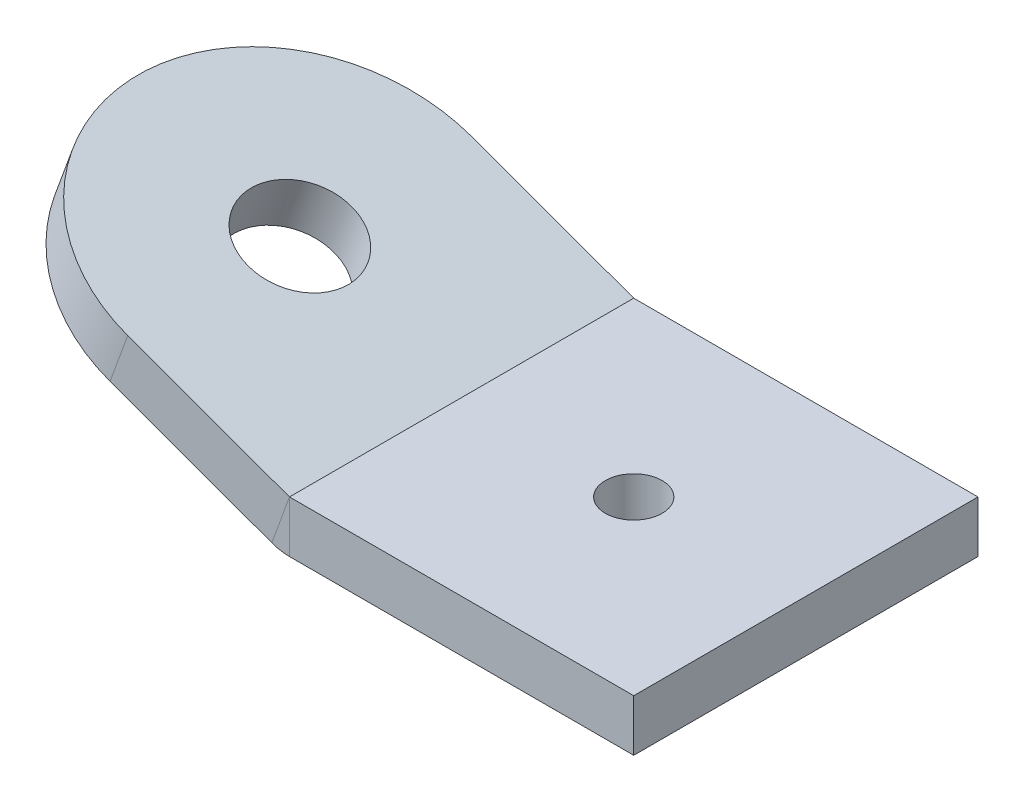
ISO-10303-21;
HEADER;
FILE_DESCRIPTION(('STEP AP214'),'2;1');
FILE_NAME('part.step','',(''),(''),'','','');
FILE_SCHEMA(('AUTOMOTIVE_DESIGN { 1 0 10303 214 1 1 1 1 }'));
ENDSEC;
DATA;
#1=APPLICATION_CONTEXT('core data for automotive mechanical design processes');
#2=APPLICATION_PROTOCOL_DEFINITION('international standard','automotive_design',2000,#1);
#3=PRODUCT_CONTEXT('',#1,'mechanical');
#4=PRODUCT('Part','Part','',(#3));
#5=PRODUCT_RELATED_PRODUCT_CATEGORY('part','',(#4));
#6=PRODUCT_DEFINITION_FORMATION('','',#4);
#7=PRODUCT_DEFINITION_CONTEXT('part definition',#1,'design');
#8=PRODUCT_DEFINITION('design','',#6,#7);
#9=PRODUCT_DEFINITION_SHAPE('','',#8);
#10=(LENGTH_UNIT() NAMED_UNIT(*) SI_UNIT(.MILLI.,.METRE.));
#11=(NAMED_UNIT(*) PLANE_ANGLE_UNIT() SI_UNIT($,.RADIAN.));
#12=(NAMED_UNIT(*) SI_UNIT($,.STERADIAN.) SOLID_ANGLE_UNIT());
#13=UNCERTAINTY_MEASURE_WITH_UNIT(LENGTH_MEASURE(1.E-05),#10,'distance_accuracy_value','');
#14=(GEOMETRIC_REPRESENTATION_CONTEXT(3) GLOBAL_UNCERTAINTY_ASSIGNED_CONTEXT((#13)) GLOBAL_UNIT_ASSIGNED_CONTEXT((#10,
#11,#12)) REPRESENTATION_CONTEXT('',''));
#15=CARTESIAN_POINT('',(0.,0.,0.));
#16=DIRECTION('',(0.,0.,1.));
#17=DIRECTION('',(1.,0.,0.));
#18=AXIS2_PLACEMENT_3D('',#15,#16,#17);
#19=CARTESIAN_POINT('',(0.603080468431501,6.42020025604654,-9.99999999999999));
#20=DIRECTION('',(0.,0.,1.));
#21=DIRECTION('',(0.939692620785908,-0.342020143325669,0.));
#22=AXIS2_PLACEMENT_3D('',#19,#20,#21);
#23=PLANE('',#22);
#24=DIRECTION('',(-0.939692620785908,0.342020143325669,0.));
#25=VECTOR('',#24,1.);
#26=CARTESIAN_POINT('',(0.603080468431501,6.42020025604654,-9.99999999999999));
#27=LINE('',#26,#25);
#28=CARTESIAN_POINT('',(9.99983774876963,3.00006030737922,-9.99999999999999));
#29=VERTEX_POINT('',#28);
#30=CARTESIAN_POINT('',(0.603080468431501,6.42020025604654,-9.99999999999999));
#31=VERTEX_POINT('',#30);
#32=EDGE_CURVE('E53',#29,#31,#27,.T.);
#33=ORIENTED_EDGE('',*,*,#32,.F.);
#34=DIRECTION('',(-0.342020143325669,-0.939692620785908,0.));
#35=VECTOR('',#34,1.);
#36=CARTESIAN_POINT('',(9.99983774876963,3.00006030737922,-9.99999999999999));
#37=LINE('',#36,#35);
#38=CARTESIAN_POINT('',(8.97377731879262,0.180982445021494,-9.99999999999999));
#39=VERTEX_POINT('',#38);
#40=EDGE_CURVE('E14',#29,#39,#37,.T.);
#41=ORIENTED_EDGE('',*,*,#40,.T.);
#42=DIRECTION('',(-0.939692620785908,0.342020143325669,0.));
#43=VECTOR('',#42,1.);
#44=CARTESIAN_POINT('',(-0.422979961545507,3.60112239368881,-9.99999999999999));
#45=LINE('',#44,#43);
#46=CARTESIAN_POINT('',(-0.422979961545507,3.60112239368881,-9.99999999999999));
#47=VERTEX_POINT('',#46);
#48=EDGE_CURVE('E66',#39,#47,#45,.T.);
#49=ORIENTED_EDGE('',*,*,#48,.T.);
#50=DIRECTION('',(-0.342020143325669,-0.939692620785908,0.));
#51=VECTOR('',#50,1.);
#52=CARTESIAN_POINT('',(0.603080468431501,6.42020025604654,-9.99999999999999));
#53=LINE('',#52,#51);
#54=EDGE_CURVE('E194',#31,#47,#53,.T.);
#55=ORIENTED_EDGE('',*,*,#54,.F.);
#56=EDGE_LOOP('',(#33,#41,#49,#55));
#57=FACE_BOUND('',#56,.T.);
#58=ADVANCED_FACE('F50',(#57),#23,.F.);
#59=CARTESIAN_POINT('',(28.7938590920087,-3.84040404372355,9.99999999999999));
#60=DIRECTION('',(0.,0.,-1.));
#61=DIRECTION('',(-0.939692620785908,0.342020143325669,0.));
#62=AXIS2_PLACEMENT_3D('',#59,#60,#61);
#63=PLANE('',#62);
#64=DIRECTION('',(0.939692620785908,-0.342020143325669,0.));
#65=VECTOR('',#64,1.);
#66=CARTESIAN_POINT('',(27.7677986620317,-6.65948190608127,9.99999999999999));
#67=LINE('',#66,#65);
#68=CARTESIAN_POINT('',(-0.422979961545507,3.60112239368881,9.99999999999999));
#69=VERTEX_POINT('',#68);
#70=CARTESIAN_POINT('',(8.97377731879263,0.18098244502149,9.99999999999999));
#71=VERTEX_POINT('',#70);
#72=EDGE_CURVE('E73',#69,#71,#67,.T.);
#73=ORIENTED_EDGE('',*,*,#72,.T.);
#74=DIRECTION('',(0.342020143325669,0.939692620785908,0.));
#75=VECTOR('',#74,1.);
#76=CARTESIAN_POINT('',(9.99983774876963,3.00006030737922,9.99999999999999));
#77=LINE('',#76,#75);
#78=CARTESIAN_POINT('',(9.99983774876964,3.00006030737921,9.99999999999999));
#79=VERTEX_POINT('',#78);
#80=EDGE_CURVE('E200',#71,#79,#77,.T.);
#81=ORIENTED_EDGE('',*,*,#80,.T.);
#82=DIRECTION('',(0.939692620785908,-0.342020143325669,0.));
#83=VECTOR('',#82,1.);
#84=CARTESIAN_POINT('',(28.7938590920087,-3.84040404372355,9.99999999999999));
#85=LINE('',#84,#83);
#86=CARTESIAN_POINT('',(0.603080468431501,6.42020025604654,9.99999999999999));
#87=VERTEX_POINT('',#86);
#88=EDGE_CURVE('E191',#87,#79,#85,.T.);
#89=ORIENTED_EDGE('',*,*,#88,.F.);
#90=DIRECTION('',(-0.342020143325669,-0.939692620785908,0.));
#91=VECTOR('',#90,1.);
#92=CARTESIAN_POINT('',(0.603080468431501,6.42020025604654,9.99999999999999));
#93=LINE('',#92,#91);
#94=EDGE_CURVE('E197',#87,#69,#93,.T.);
#95=ORIENTED_EDGE('',*,*,#94,.T.);
#96=EDGE_LOOP('',(#73,#81,#89,#95));
#97=FACE_BOUND('',#96,.T.);
#98=ADVANCED_FACE('F216',(#97),#63,.F.);
#99=CARTESIAN_POINT('',(-0.422979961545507,3.60112239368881,0.));
#100=DIRECTION('',(0.342020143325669,0.939692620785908,0.));
#101=DIRECTION('',(0.,0.,1.));
#102=AXIS2_PLACEMENT_3D('',#99,#100,#101);
#103=PLANE('',#102);
#104=CARTESIAN_POINT('',(-0.422979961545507,3.60112239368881,0.));
#105=DIRECTION('',(0.342020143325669,0.939692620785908,0.));
#106=DIRECTION('',(0.,0.,1.));
#107=AXIS2_PLACEMENT_3D('',#104,#105,#106);
#108=CIRCLE('',#107,3.);
#109=CARTESIAN_POINT('',(-0.422979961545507,3.60112239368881,3.));
#110=VERTEX_POINT('',#109);
#111=EDGE_CURVE('E165',#110,#110,#108,.T.);
#112=ORIENTED_EDGE('',*,*,#111,.T.);
#113=EDGE_LOOP('',(#112));
#114=FACE_BOUND('',#113,.T.);
#115=ORIENTED_EDGE('',*,*,#48,.F.);
#116=DIRECTION('',(0.,0.,1.));
#117=VECTOR('',#116,1.);
#118=CARTESIAN_POINT('',(8.97377731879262,0.180982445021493,0.));
#119=LINE('',#118,#117);
#120=EDGE_CURVE('E58',#39,#71,#119,.T.);
#121=ORIENTED_EDGE('',*,*,#120,.T.);
#122=ORIENTED_EDGE('',*,*,#72,.F.);
#123=CARTESIAN_POINT('',(-0.422979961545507,3.60112239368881,0.));
#124=DIRECTION('',(0.342020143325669,0.939692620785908,0.));
#125=DIRECTION('',(0.,0.,1.));
#126=AXIS2_PLACEMENT_3D('',#123,#124,#125);
#127=CIRCLE('',#126,9.99999999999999);
#128=EDGE_CURVE('E185',#47,#69,#127,.T.);
#129=ORIENTED_EDGE('',*,*,#128,.F.);
#130=EDGE_LOOP('',(#115,#121,#122,#129));
#131=FACE_BOUND('',#130,.T.);
#132=ADVANCED_FACE('F251',(#114,#131),#103,.F.);
#133=CARTESIAN_POINT('',(0.603080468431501,6.42020025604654,0.));
#134=DIRECTION('',(0.342020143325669,0.939692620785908,0.));
#135=DIRECTION('',(0.,0.,1.));
#136=AXIS2_PLACEMENT_3D('',#133,#134,#135);
#137=PLANE('',#136);
#138=DIRECTION('',(0.,0.,1.));
#139=VECTOR('',#138,1.);
#140=CARTESIAN_POINT('',(9.99983774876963,3.00006030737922,0.));
#141=LINE('',#140,#139);
#142=EDGE_CURVE('E151',#29,#79,#141,.T.);
#143=ORIENTED_EDGE('',*,*,#142,.F.);
#144=ORIENTED_EDGE('',*,*,#32,.T.);
#145=CARTESIAN_POINT('',(0.603080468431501,6.42020025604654,0.));
#146=DIRECTION('',(0.342020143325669,0.939692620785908,0.));
#147=DIRECTION('',(0.,0.,1.));
#148=AXIS2_PLACEMENT_3D('',#145,#146,#147);
#149=CIRCLE('',#148,9.99999999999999);
#150=EDGE_CURVE('E188',#31,#87,#149,.T.);
#151=ORIENTED_EDGE('',*,*,#150,.T.);
#152=ORIENTED_EDGE('',*,*,#88,.T.);
#153=EDGE_LOOP('',(#143,#144,#151,#152));
#154=FACE_BOUND('',#153,.T.);
#155=CARTESIAN_POINT('',(0.603080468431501,6.42020025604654,0.));
#156=DIRECTION('',(0.342020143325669,0.939692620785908,0.));
#157=DIRECTION('',(0.,0.,1.));
#158=AXIS2_PLACEMENT_3D('',#155,#156,#157);
#159=CIRCLE('',#158,3.);
#160=CARTESIAN_POINT('',(0.603080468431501,6.42020025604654,3.));
#161=VERTEX_POINT('',#160);
#162=EDGE_CURVE('E182',#161,#161,#159,.T.);
#163=ORIENTED_EDGE('',*,*,#162,.F.);
#164=EDGE_LOOP('',(#163));
#165=FACE_BOUND('',#164,.T.);
#166=ADVANCED_FACE('F208',(#154,#165),#137,.T.);
#167=CARTESIAN_POINT('',(0.603080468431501,6.42020025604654,0.));
#168=DIRECTION('',(-0.342020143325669,-0.939692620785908,0.));
#169=DIRECTION('',(0.,0.,-1.));
#170=AXIS2_PLACEMENT_3D('',#167,#168,#169);
#171=CYLINDRICAL_SURFACE('',#170,9.99999999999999);
#172=ORIENTED_EDGE('',*,*,#128,.T.);
#173=ORIENTED_EDGE('',*,*,#94,.F.);
#174=ORIENTED_EDGE('',*,*,#150,.F.);
#175=ORIENTED_EDGE('',*,*,#54,.T.);
#176=EDGE_LOOP('',(#172,#173,#174,#175));
#177=FACE_BOUND('',#176,.T.);
#178=ADVANCED_FACE('F215',(#177),#171,.T.);
#179=CARTESIAN_POINT('',(0.603080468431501,6.42020025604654,0.));
#180=DIRECTION('',(-0.342020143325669,-0.939692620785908,0.));
#181=DIRECTION('',(0.,0.,-1.));
#182=AXIS2_PLACEMENT_3D('',#179,#180,#181);
#183=CYLINDRICAL_SURFACE('',#182,3.);
#184=ORIENTED_EDGE('',*,*,#162,.T.);
#185=EDGE_LOOP('',(#184));
#186=FACE_BOUND('',#185,.T.);
#187=ORIENTED_EDGE('',*,*,#111,.F.);
#188=EDGE_LOOP('',(#187));
#189=FACE_BOUND('',#188,.T.);
#190=ADVANCED_FACE('F236',(#186,#189),#183,.F.);
#191=CARTESIAN_POINT('',(30.,3.,-9.99999999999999));
#192=DIRECTION('',(-1.,0.,0.));
#193=DIRECTION('',(0.,0.,1.));
#194=AXIS2_PLACEMENT_3D('',#191,#192,#193);
#195=PLANE('',#194);
#196=DIRECTION('',(0.,0.,-1.));
#197=VECTOR('',#196,1.);
#198=CARTESIAN_POINT('',(30.,0.,-9.99999999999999));
#199=LINE('',#198,#197);
#200=CARTESIAN_POINT('',(30.,0.,9.99999999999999));
#201=VERTEX_POINT('',#200);
#202=CARTESIAN_POINT('',(30.,0.,-9.99999999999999));
#203=VERTEX_POINT('',#202);
#204=EDGE_CURVE('E146',#201,#203,#199,.T.);
#205=ORIENTED_EDGE('',*,*,#204,.T.);
#206=DIRECTION('',(0.,-1.,0.));
#207=VECTOR('',#206,1.);
#208=CARTESIAN_POINT('',(30.,3.,-9.99999999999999));
#209=LINE('',#208,#207);
#210=CARTESIAN_POINT('',(30.,3.,-9.99999999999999));
#211=VERTEX_POINT('',#210);
#212=EDGE_CURVE('E166',#211,#203,#209,.T.);
#213=ORIENTED_EDGE('',*,*,#212,.F.);
#214=DIRECTION('',(0.,0.,-1.));
#215=VECTOR('',#214,1.);
#216=CARTESIAN_POINT('',(30.,3.,-9.99999999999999));
#217=LINE('',#216,#215);
#218=CARTESIAN_POINT('',(30.,3.,9.99999999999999));
#219=VERTEX_POINT('',#218);
#220=EDGE_CURVE('E125',#219,#211,#217,.T.);
#221=ORIENTED_EDGE('',*,*,#220,.F.);
#222=DIRECTION('',(0.,-1.,0.));
#223=VECTOR('',#222,1.);
#224=CARTESIAN_POINT('',(30.,3.,9.99999999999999));
#225=LINE('',#224,#223);
#226=EDGE_CURVE('E122',#219,#201,#225,.T.);
#227=ORIENTED_EDGE('',*,*,#226,.T.);
#228=EDGE_LOOP('',(#205,#213,#221,#227));
#229=FACE_BOUND('',#228,.T.);
#230=ADVANCED_FACE('F233',(#229),#195,.F.);
#231=CARTESIAN_POINT('',(20.,3.,0.));
#232=DIRECTION('',(0.,1.,0.));
#233=DIRECTION('',(0.,0.,1.));
#234=AXIS2_PLACEMENT_3D('',#231,#232,#233);
#235=CYLINDRICAL_SURFACE('',#234,1.64999999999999);
#236=CARTESIAN_POINT('',(20.,0.,0.));
#237=DIRECTION('',(0.,1.,0.));
#238=DIRECTION('',(0.,0.,1.));
#239=AXIS2_PLACEMENT_3D('',#236,#237,#238);
#240=CIRCLE('',#239,1.65);
#241=CARTESIAN_POINT('',(20.,0.,1.65));
#242=VERTEX_POINT('',#241);
#243=EDGE_CURVE('E169',#242,#242,#240,.T.);
#244=ORIENTED_EDGE('',*,*,#243,.F.);
#245=EDGE_LOOP('',(#244));
#246=FACE_BOUND('',#245,.T.);
#247=CARTESIAN_POINT('',(20.,3.,0.));
#248=DIRECTION('',(0.,1.,0.));
#249=DIRECTION('',(0.,0.,1.));
#250=AXIS2_PLACEMENT_3D('',#247,#248,#249);
#251=CIRCLE('',#250,1.64999999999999);
#252=CARTESIAN_POINT('',(20.,3.,1.64999999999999));
#253=VERTEX_POINT('',#252);
#254=EDGE_CURVE('E176',#253,#253,#251,.T.);
#255=ORIENTED_EDGE('',*,*,#254,.T.);
#256=EDGE_LOOP('',(#255));
#257=FACE_BOUND('',#256,.T.);
#258=ADVANCED_FACE('F235',(#246,#257),#235,.F.);
#259=CARTESIAN_POINT('',(0.,3.,0.));
#260=DIRECTION('',(0.,1.,0.));
#261=DIRECTION('',(0.,0.,1.));
#262=AXIS2_PLACEMENT_3D('',#259,#260,#261);
#263=PLANE('',#262);
#264=ORIENTED_EDGE('',*,*,#254,.F.);
#265=EDGE_LOOP('',(#264));
#266=FACE_BOUND('',#265,.T.);
#267=DIRECTION('',(-1.,0.,0.));
#268=VECTOR('',#267,1.);
#269=CARTESIAN_POINT('',(0.,3.,-9.99999999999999));
#270=LINE('',#269,#268);
#271=CARTESIAN_POINT('',(10.000179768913,3.,-9.99999999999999));
#272=VERTEX_POINT('',#271);
#273=EDGE_CURVE('E131',#211,#272,#270,.T.);
#274=ORIENTED_EDGE('',*,*,#273,.T.);
#275=DIRECTION('',(0.,0.,1.));
#276=VECTOR('',#275,1.);
#277=CARTESIAN_POINT('',(10.000179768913,3.,0.));
#278=LINE('',#277,#276);
#279=CARTESIAN_POINT('',(10.000179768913,3.,9.99999999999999));
#280=VERTEX_POINT('',#279);
#281=EDGE_CURVE('E126',#272,#280,#278,.T.);
#282=ORIENTED_EDGE('',*,*,#281,.T.);
#283=DIRECTION('',(1.,0.,0.));
#284=VECTOR('',#283,1.);
#285=CARTESIAN_POINT('',(30.,3.,9.99999999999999));
#286=LINE('',#285,#284);
#287=EDGE_CURVE('E115',#280,#219,#286,.T.);
#288=ORIENTED_EDGE('',*,*,#287,.T.);
#289=ORIENTED_EDGE('',*,*,#220,.T.);
#290=EDGE_LOOP('',(#274,#282,#288,#289));
#291=FACE_BOUND('',#290,.T.);
#292=ADVANCED_FACE('F129',(#266,#291),#263,.T.);
#293=CARTESIAN_POINT('',(30.,3.,9.99999999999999));
#294=DIRECTION('',(0.,0.,-1.));
#295=DIRECTION('',(-1.,0.,0.));
#296=AXIS2_PLACEMENT_3D('',#293,#294,#295);
#297=PLANE('',#296);
#298=DIRECTION('',(0.,1.,0.));
#299=VECTOR('',#298,1.);
#300=CARTESIAN_POINT('',(10.000179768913,3.,9.99999999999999));
#301=LINE('',#300,#299);
#302=CARTESIAN_POINT('',(10.000179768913,0.,9.99999999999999));
#303=VERTEX_POINT('',#302);
#304=EDGE_CURVE('E119',#303,#280,#301,.T.);
#305=ORIENTED_EDGE('',*,*,#304,.F.);
#306=DIRECTION('',(1.,0.,0.));
#307=VECTOR('',#306,1.);
#308=CARTESIAN_POINT('',(30.,0.,9.99999999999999));
#309=LINE('',#308,#307);
#310=EDGE_CURVE('E172',#303,#201,#309,.T.);
#311=ORIENTED_EDGE('',*,*,#310,.T.);
#312=ORIENTED_EDGE('',*,*,#226,.F.);
#313=ORIENTED_EDGE('',*,*,#287,.F.);
#314=EDGE_LOOP('',(#305,#311,#312,#313));
#315=FACE_BOUND('',#314,.T.);
#316=ADVANCED_FACE('F117',(#315),#297,.F.);
#317=CARTESIAN_POINT('',(0.,0.,0.));
#318=DIRECTION('',(0.,1.,0.));
#319=DIRECTION('',(0.,0.,1.));
#320=AXIS2_PLACEMENT_3D('',#317,#318,#319);
#321=PLANE('',#320);
#322=DIRECTION('',(0.,0.,1.));
#323=VECTOR('',#322,1.);
#324=CARTESIAN_POINT('',(10.000179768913,0.,0.));
#325=LINE('',#324,#323);
#326=CARTESIAN_POINT('',(10.000179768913,0.,-9.99999999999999));
#327=VERTEX_POINT('',#326);
#328=EDGE_CURVE('E147',#327,#303,#325,.T.);
#329=ORIENTED_EDGE('',*,*,#328,.F.);
#330=DIRECTION('',(-1.,0.,0.));
#331=VECTOR('',#330,1.);
#332=CARTESIAN_POINT('',(0.,0.,-9.99999999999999));
#333=LINE('',#332,#331);
#334=EDGE_CURVE('E163',#203,#327,#333,.T.);
#335=ORIENTED_EDGE('',*,*,#334,.F.);
#336=ORIENTED_EDGE('',*,*,#204,.F.);
#337=ORIENTED_EDGE('',*,*,#310,.F.);
#338=EDGE_LOOP('',(#329,#335,#336,#337));
#339=FACE_BOUND('',#338,.T.);
#340=ORIENTED_EDGE('',*,*,#243,.T.);
#341=EDGE_LOOP('',(#340));
#342=FACE_BOUND('',#341,.T.);
#343=ADVANCED_FACE('F224',(#339,#342),#321,.F.);
#344=CARTESIAN_POINT('',(0.,3.,-9.99999999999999));
#345=DIRECTION('',(0.,0.,1.));
#346=DIRECTION('',(1.,0.,0.));
#347=AXIS2_PLACEMENT_3D('',#344,#345,#346);
#348=PLANE('',#347);
#349=DIRECTION('',(0.,-1.,0.));
#350=VECTOR('',#349,1.);
#351=CARTESIAN_POINT('',(10.000179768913,3.,-9.99999999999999));
#352=LINE('',#351,#350);
#353=EDGE_CURVE('E152',#272,#327,#352,.T.);
#354=ORIENTED_EDGE('',*,*,#353,.F.);
#355=ORIENTED_EDGE('',*,*,#273,.F.);
#356=ORIENTED_EDGE('',*,*,#212,.T.);
#357=ORIENTED_EDGE('',*,*,#334,.T.);
#358=EDGE_LOOP('',(#354,#355,#356,#357));
#359=FACE_BOUND('',#358,.T.);
#360=ADVANCED_FACE('F230',(#359),#348,.F.);
#361=CARTESIAN_POINT('',(10.000179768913,3.001,-9.99999999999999));
#362=DIRECTION('',(0.,0.,1.));
#363=DIRECTION('',(1.,0.,0.));
#364=AXIS2_PLACEMENT_3D('',#361,#362,#363);
#365=PLANE('',#364);
#366=ORIENTED_EDGE('',*,*,#353,.T.);
#367=CARTESIAN_POINT('',(10.000179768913,3.001,-9.99999999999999));
#368=DIRECTION('',(0.,0.,1.));
#369=DIRECTION('',(1.,0.,0.));
#370=AXIS2_PLACEMENT_3D('',#367,#368,#369);
#371=CIRCLE('',#370,3.001);
#372=EDGE_CURVE('E159',#327,#39,#371,.F.);
#373=ORIENTED_EDGE('',*,*,#372,.T.);
#374=ORIENTED_EDGE('',*,*,#40,.F.);
#375=CARTESIAN_POINT('',(10.000179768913,3.001,-9.99999999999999));
#376=DIRECTION('',(0.,0.,-1.));
#377=DIRECTION('',(-1.,0.,0.));
#378=AXIS2_PLACEMENT_3D('',#375,#376,#377);
#379=CIRCLE('',#378,0.000999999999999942);
#380=EDGE_CURVE('E153',#272,#29,#379,.T.);
#381=ORIENTED_EDGE('',*,*,#380,.F.);
#382=EDGE_LOOP('',(#366,#373,#374,#381));
#383=FACE_BOUND('',#382,.T.);
#384=ADVANCED_FACE('F228',(#383),#365,.F.);
#385=CARTESIAN_POINT('',(10.000179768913,3.001,9.99999999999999));
#386=DIRECTION('',(0.,0.,-1.));
#387=DIRECTION('',(-1.,0.,0.));
#388=AXIS2_PLACEMENT_3D('',#385,#386,#387);
#389=PLANE('',#388);
#390=CARTESIAN_POINT('',(10.000179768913,3.001,9.99999999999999));
#391=DIRECTION('',(0.,0.,1.));
#392=DIRECTION('',(1.,0.,0.));
#393=AXIS2_PLACEMENT_3D('',#390,#391,#392);
#394=CIRCLE('',#393,3.001);
#395=EDGE_CURVE('E145',#71,#303,#394,.T.);
#396=ORIENTED_EDGE('',*,*,#395,.T.);
#397=ORIENTED_EDGE('',*,*,#304,.T.);
#398=CARTESIAN_POINT('',(10.000179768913,3.001,9.99999999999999));
#399=DIRECTION('',(0.,0.,1.));
#400=DIRECTION('',(1.,0.,0.));
#401=AXIS2_PLACEMENT_3D('',#398,#399,#400);
#402=CIRCLE('',#401,0.000999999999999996);
#403=EDGE_CURVE('E143',#79,#280,#402,.T.);
#404=ORIENTED_EDGE('',*,*,#403,.F.);
#405=ORIENTED_EDGE('',*,*,#80,.F.);
#406=EDGE_LOOP('',(#396,#397,#404,#405));
#407=FACE_BOUND('',#406,.T.);
#408=ADVANCED_FACE('F141',(#407),#389,.F.);
#409=CARTESIAN_POINT('',(10.000179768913,3.001,-20.2237484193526));
#410=DIRECTION('',(0.,0.,1.));
#411=DIRECTION('',(1.,0.,0.));
#412=AXIS2_PLACEMENT_3D('',#409,#410,#411);
#413=CYLINDRICAL_SURFACE('',#412,0.001);
#414=ORIENTED_EDGE('',*,*,#142,.T.);
#415=ORIENTED_EDGE('',*,*,#403,.T.);
#416=ORIENTED_EDGE('',*,*,#281,.F.);
#417=ORIENTED_EDGE('',*,*,#380,.T.);
#418=EDGE_LOOP('',(#414,#415,#416,#417));
#419=FACE_BOUND('',#418,.T.);
#420=ADVANCED_FACE('F150',(#419),#413,.F.);
#421=CARTESIAN_POINT('',(10.000179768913,3.001,-20.2237484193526));
#422=DIRECTION('',(0.,0.,1.));
#423=DIRECTION('',(1.,0.,0.));
#424=AXIS2_PLACEMENT_3D('',#421,#422,#423);
#425=CYLINDRICAL_SURFACE('',#424,3.001);
#426=ORIENTED_EDGE('',*,*,#120,.F.);
#427=ORIENTED_EDGE('',*,*,#372,.F.);
#428=ORIENTED_EDGE('',*,*,#328,.T.);
#429=ORIENTED_EDGE('',*,*,#395,.F.);
#430=EDGE_LOOP('',(#426,#427,#428,#429));
#431=FACE_BOUND('',#430,.T.);
#432=ADVANCED_FACE('F219',(#431),#425,.T.);
#433=CLOSED_SHELL('',(#58,#98,#132,#166,#178,#190,#230,#258,#292,#316,#343,#360,#384,#408,#420,#432));
#434=MANIFOLD_SOLID_BREP('B2',#433);
#435=ADVANCED_BREP_SHAPE_REPRESENTATION('',(#18,#434),#14);
#436=SHAPE_DEFINITION_REPRESENTATION(#9,#435);
ENDSEC;
END-ISO-10303-21;
